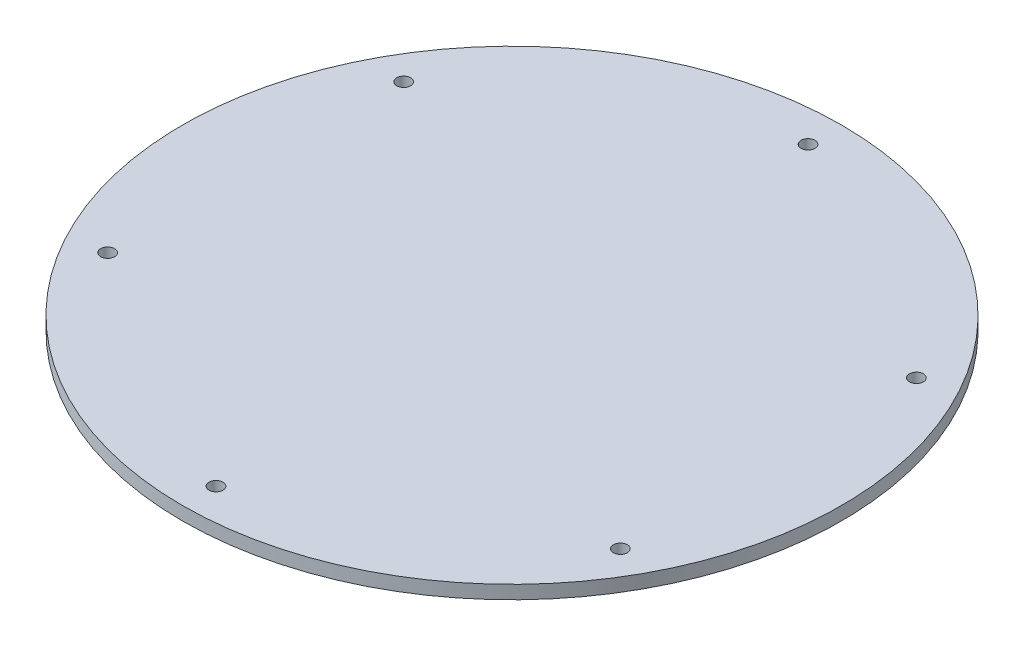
from build123d import *

# Parameters (mm, degrees)
SKETCH1_R           = 149.86
SKETCH1_R_2         = 3.175
BOSS_EXTRUDE2_DEPTH = 6.096


with BuildPart() as part:
    # Sketch1 → Boss-Extrude2 (new body)
    with BuildSketch(Plane(origin=(0, 0, 0), x_dir=(1, 0, 0), z_dir=(0, 1, 0))):
        with Locations(Location((0, 0, 0), (0, 0, 90))):
            Circle(SKETCH1_R)
        with Locations(Location((-116.584339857, -67.31, 0), (0, 0, 90))):
            Circle(SKETCH1_R_2, mode=Mode.SUBTRACT)
        with Locations(Location((-116.584339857, 67.31, 0), (0, 0, 90))):
            Circle(SKETCH1_R_2, mode=Mode.SUBTRACT)
        with Locations(Location((0, 134.62, 0), (0, 0, 90))):
            Circle(SKETCH1_R_2, mode=Mode.SUBTRACT)
        with Locations(Location((116.584339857, 67.31, 0), (0, 0, 90))):
            Circle(SKETCH1_R_2, mode=Mode.SUBTRACT)
        with Locations(Location((116.584339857, -67.31, 0), (0, 0, 90))):
            Circle(SKETCH1_R_2, mode=Mode.SUBTRACT)
        with Locations(Location((0, -134.62, 0), (0, 0, 90))):
            Circle(SKETCH1_R_2, mode=Mode.SUBTRACT)
    extrude(amount=BOSS_EXTRUDE2_DEPTH)


solid = part.part
